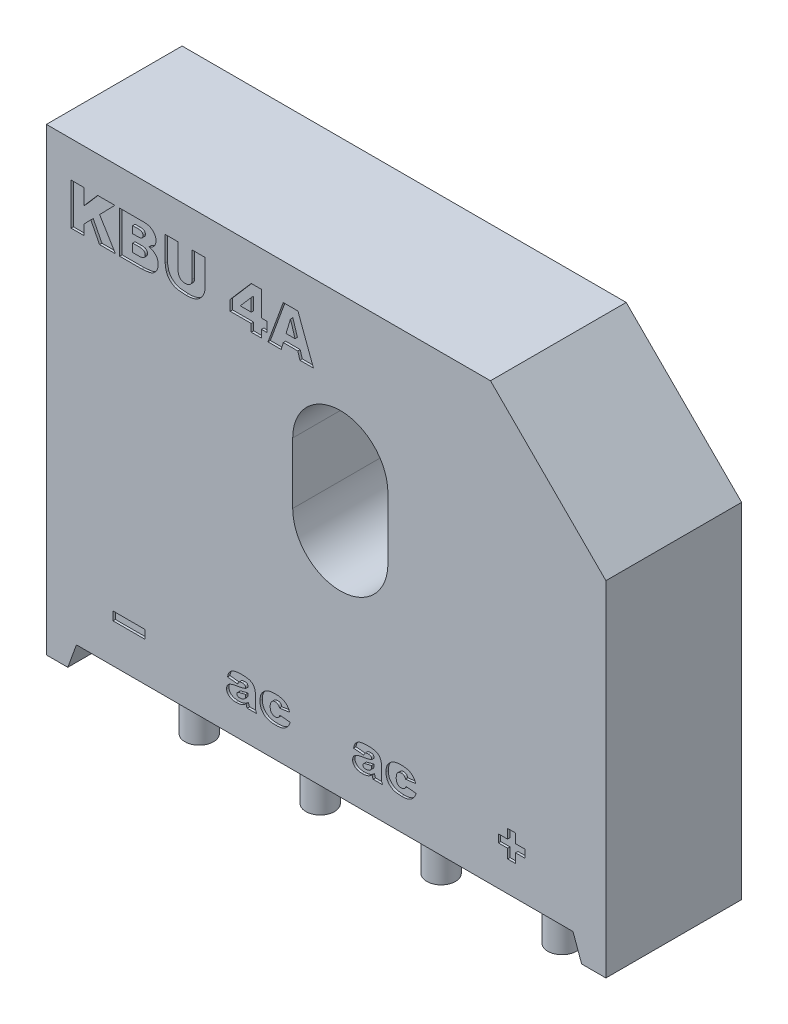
from build123d import *

# Parameters (mm, degrees)
BRIDGE_BODY_EXTRUDE_DEPTH = 5.7
SKETCH2_W                 = 1.346153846
SKETCH2_H                 = 0.358974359
PIN_TEXT_CUT_DEPTH        = 0.1
SKETCH3_R                 = 0.6
PCB_PIN_EXTRUDE_DEPTH     = 3


with BuildPart() as part:
    # Sketch1 → Bridge Body Extrude (new body)
    with BuildSketch(Plane.XY):
        Polygon((0, 0), (0, 19.3), (18.652387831, 19.3), (23.5, 14.452387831), (23.5, 0), (22.479931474, 0), (22.118360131, 1), (1.26151615, 1), (0.899944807, 0), align=None)
        with BuildLine():
            Line((10.345307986, 10.5), (10.345307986, 13.065013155))
            ThreePointArc((10.345307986, 13.065013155), (12.345307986, 15.065013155), (14.345307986, 13.065013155))
            Line((14.345307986, 13.065013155), (14.345307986, 10.5))
            ThreePointArc((14.345307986, 10.5), (12.345307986, 8.5), (10.345307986, 10.5))
        make_face(mode=Mode.SUBTRACT)
    extrude(amount=BRIDGE_BODY_EXTRUDE_DEPTH)

    # Sketch2 → Pin Text Cut (cut)
    # profile 1 of 11: a face of its own
    with BuildSketch(Plane.XY.offset(5.7)):
        with Locations((3.469213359, 2.820323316)):
            Rectangle(SKETCH2_W, SKETCH2_H)
    # profile 2 of 11: a face of its own
    with BuildSketch(Plane.XY.offset(5.7)):
        Polygon((18.981653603, 2.987122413), (19.371263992, 2.987122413), (19.371263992, 3.376732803), (19.702432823, 3.376732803), (19.702432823, 2.987122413), (20.092043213, 2.987122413), (20.092043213, 2.655953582), (19.702432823, 2.655953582), (19.702432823, 2.266343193), (19.371263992, 2.266343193), (19.371263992, 2.655953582), (18.981653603, 2.655953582), align=None)
    # profile 3 of 11: a face of its own
    with BuildSketch(Plane.XY.offset(5.7)):
        with BuildLine():
            Line((8.035976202, 2.963876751), (7.607404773, 3.00283779))
            add(Edge.make_bspline(
                [(7.607404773, 3.00283779), (7.611247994, 3.02209047), (7.618574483, 3.058792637), (7.633935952, 3.109908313), (7.650974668, 3.154884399), (7.671457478, 3.193975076), (7.695799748, 3.22857989), (7.724491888, 3.260046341), (7.757398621, 3.289564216), (7.782214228, 3.306482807), (7.794904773, 3.315134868)],
                knots=[0, 0, 0, 0, 1.250801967, 2.384454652, 3.398131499, 4.312349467, 5.189772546, 6.087297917, 7.021856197, 8, 8, 8, 8], degree=3))
            add(Edge.make_bspline(
                [(7.794904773, 3.315134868), (7.805224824, 3.32117941), (7.827022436, 3.333946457), (7.86437093, 3.348652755), (7.906607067, 3.362158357), (7.953845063, 3.372640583), (8.004622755, 3.381472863), (8.057977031, 3.387678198), (8.11342507, 3.391880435), (8.151024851, 3.392256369), (8.170209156, 3.39244818)],
                knots=[0, 0, 0, 0, 0.739921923, 1.562834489, 2.479237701, 3.48553629, 4.557106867, 5.671190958, 6.811786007, 8, 8, 8, 8], degree=3))
            add(Edge.make_bspline(
                [(8.170209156, 3.39244818), (8.185428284, 3.392380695), (8.215159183, 3.392248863), (8.258600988, 3.391487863), (8.299780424, 3.38942203), (8.338674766, 3.387568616), (8.375198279, 3.384417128), (8.4094045, 3.380808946), (8.441277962, 3.376561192), (8.480213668, 3.370339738), (8.525487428, 3.359374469), (8.575796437, 3.340537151), (8.621689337, 3.315938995), (8.64828003, 3.294655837), (8.661483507, 3.28408779)],
                knots=[0, 0, 0, 0, 1.066103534, 2.082656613, 3.043075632, 3.954156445, 4.809976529, 5.610538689, 6.363398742, 7.062112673, 8.372172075, 9.618264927, 10.817361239, 12, 12, 12, 12], degree=3))
            add(Edge.make_bspline(
                [(8.661483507, 3.28408779), (8.670167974, 3.275908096), (8.687997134, 3.259115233), (8.710417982, 3.228428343), (8.729915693, 3.19306638), (8.746122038, 3.153838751), (8.759215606, 3.112847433), (8.769063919, 3.072083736), (8.77521361, 3.032145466), (8.775898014, 3.005800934), (8.776235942, 2.992793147)],
                knots=[0, 0, 0, 0, 0.889367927, 1.825867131, 2.823050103, 3.899548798, 4.989798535, 6.033644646, 7.029098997, 8, 8, 8, 8], degree=3))
            Line((8.776235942, 2.992793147), (8.776235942, 2.513085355))
            add(Edge.make_bspline(
                [(8.776235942, 2.513085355), (8.776339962, 2.501009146), (8.776536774, 2.47816028), (8.778313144, 2.445957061), (8.781247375, 2.417899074), (8.785537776, 2.39279469), (8.792510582, 2.368459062), (8.801673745, 2.342207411), (8.813998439, 2.313043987), (8.823541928, 2.292778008), (8.828589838, 2.282058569)],
                knots=[0, 0, 0, 0, 1.20877915, 2.287078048, 3.226967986, 4.031824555, 4.832633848, 5.757700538, 6.8139634, 8, 8, 8, 8], degree=3))
            Line((8.828589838, 2.282058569), (8.435935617, 2.282058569))
            add(Edge.make_bspline(
                [(8.435935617, 2.282058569), (8.432351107, 2.288839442), (8.425649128, 2.301517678), (8.416842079, 2.319343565), (8.409945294, 2.334607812), (8.405043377, 2.348370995), (8.401110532, 2.362391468), (8.397992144, 2.378733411), (8.394205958, 2.398172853), (8.392048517, 2.412324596), (8.390886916, 2.419944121)],
                knots=[0, 0, 0, 0, 1.25880409, 2.353593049, 3.263270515, 4.005956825, 4.749389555, 5.650798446, 6.735152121, 8, 8, 8, 8], degree=3))
            add(Edge.make_bspline(
                [(8.390886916, 2.419944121), (8.377406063, 2.407510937), (8.351341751, 2.383472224), (8.309921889, 2.352729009), (8.268938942, 2.326969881), (8.240569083, 2.313939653), (8.226824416, 2.307626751)],
                knots=[0, 0, 0, 0, 1.100307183, 2.127368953, 3.092745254, 4, 4, 4, 4], degree=3))
            add(Edge.make_bspline(
                [(8.226824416, 2.307626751), (8.207685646, 2.30056634), (8.168430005, 2.286084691), (8.105342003, 2.272842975), (8.038062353, 2.263904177), (7.991670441, 2.263028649), (7.967794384, 2.26257805)],
                knots=[0, 0, 0, 0, 0.924510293, 1.896268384, 2.917293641, 4, 4, 4, 4], degree=3))
            add(Edge.make_bspline(
                [(7.967794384, 2.26257805), (7.951958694, 2.262780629), (7.921147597, 2.263174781), (7.876484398, 2.267103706), (7.834810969, 2.273864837), (7.795960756, 2.282832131), (7.760025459, 2.294722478), (7.726887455, 2.308952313), (7.696801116, 2.326024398), (7.670086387, 2.345934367), (7.646201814, 2.367542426), (7.62561109, 2.390755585), (7.607574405, 2.414720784), (7.593581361, 2.440500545), (7.582179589, 2.467138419), (7.574296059, 2.495279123), (7.569220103, 2.524466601), (7.568704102, 2.544415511), (7.568443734, 2.554481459)],
                knots=[0, 0, 0, 0, 1.369521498, 2.664643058, 3.873708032, 5.01894698, 6.109622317, 7.143303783, 8.133876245, 9.094007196, 10.0196673, 10.914657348, 11.774759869, 12.607565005, 13.445349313, 14.275931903, 15.130058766, 16, 16, 16, 16], degree=3))
            add(Edge.make_bspline(
                [(7.568443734, 2.554481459), (7.568700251, 2.563925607), (7.56920389, 2.582468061), (7.572485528, 2.609607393), (7.578388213, 2.635347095), (7.586234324, 2.659880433), (7.596638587, 2.683163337), (7.609565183, 2.705074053), (7.624350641, 2.725943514), (7.635972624, 2.738449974), (7.641800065, 2.744720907)],
                knots=[0, 0, 0, 0, 1.082829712, 2.1260065, 3.127827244, 4.106347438, 5.074859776, 6.044489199, 7.019476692, 8, 8, 8, 8], degree=3))
            add(Edge.make_bspline(
                [(7.641800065, 2.744720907), (7.648354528, 2.750878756), (7.662139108, 2.763829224), (7.686586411, 2.780482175), (7.714741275, 2.796156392), (7.74657916, 2.81067319), (7.78259294, 2.823669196), (7.822228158, 2.835692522), (7.865776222, 2.846799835), (7.896230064, 2.852731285), (7.912092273, 2.855820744)],
                knots=[0, 0, 0, 0, 0.727635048, 1.53027691, 2.387695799, 3.336632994, 4.361190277, 5.487004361, 6.691079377, 8, 8, 8, 8], degree=3))
            add(Edge.make_bspline(
                [(7.912092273, 2.855820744), (7.930862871, 2.859370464), (7.966781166, 2.866162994), (8.018023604, 2.8758766), (8.064229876, 2.884598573), (8.105033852, 2.8930373), (8.140889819, 2.899659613), (8.171191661, 2.906698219), (8.196561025, 2.911910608), (8.236015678, 2.921595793), (8.292667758, 2.937833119), (8.341761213, 2.955000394), (8.367145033, 2.963876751)],
                knots=[0, 0, 0, 0, 1.223629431, 2.341464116, 3.340736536, 4.235467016, 5.010394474, 5.675828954, 6.227778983, 6.66913235, 8.277771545, 10, 10, 10, 10], degree=3))
            add(Edge.make_bspline(
                [(8.367145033, 2.963876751), (8.36684563, 2.975567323), (8.366289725, 2.997273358), (8.361082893, 3.027045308), (8.352081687, 3.051353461), (8.338813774, 3.070588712), (8.320333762, 3.084535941), (8.296747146, 3.093890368), (8.26797192, 3.099463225), (8.246941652, 3.09996891), (8.235651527, 3.100240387)],
                knots=[0, 0, 0, 0, 1.265153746, 2.349027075, 3.256918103, 4.052578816, 4.843675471, 5.72512393, 6.778729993, 8, 8, 8, 8], degree=3))
            add(Edge.make_bspline(
                [(8.235651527, 3.100240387), (8.221009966, 3.099889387), (8.193495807, 3.099229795), (8.155079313, 3.092919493), (8.12196039, 3.082506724), (8.103671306, 3.070986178), (8.095026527, 3.065540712)],
                knots=[0, 0, 0, 0, 1.193429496, 2.242671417, 3.169356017, 4, 4, 4, 4], degree=3))
            add(Edge.make_bspline(
                [(8.095026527, 3.065540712), (8.088976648, 3.060300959), (8.076002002, 3.049063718), (8.060978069, 3.025569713), (8.046742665, 2.9970891), (8.039733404, 2.975466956), (8.035976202, 2.963876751)],
                knots=[0, 0, 0, 0, 0.801168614, 1.71819626, 2.776875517, 4, 4, 4, 4], degree=3))
        make_face()
        with BuildLine():
            add(Edge.make_bspline(
                [(8.367145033, 2.749591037), (8.338303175, 2.741380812), (8.279816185, 2.7247317), (8.220409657, 2.711737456), (8.190298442, 2.705151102)],
                knots=[0, 0, 0, 0, 0.986265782, 2, 2, 2, 2], degree=3))
            add(Edge.make_bspline(
                [(8.190298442, 2.705151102), (8.180354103, 2.702824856), (8.161352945, 2.69837998), (8.134146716, 2.691895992), (8.110063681, 2.684822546), (8.088647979, 2.678208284), (8.070317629, 2.671231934), (8.054630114, 2.664549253), (8.041700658, 2.658124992), (8.034605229, 2.652982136), (8.031410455, 2.650666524)],
                knots=[0, 0, 0, 0, 1.451033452, 2.77256417, 3.972460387, 5.016413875, 5.956143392, 6.756781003, 7.440230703, 8, 8, 8, 8], degree=3))
            add(Edge.make_bspline(
                [(8.031410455, 2.650666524), (8.026259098, 2.646072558), (8.016433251, 2.637309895), (8.005051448, 2.621867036), (7.998297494, 2.605023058), (7.997438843, 2.593396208), (7.997015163, 2.587659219)],
                knots=[0, 0, 0, 0, 1.113594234, 2.124101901, 3.074383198, 4, 4, 4, 4], degree=3))
            add(Edge.make_bspline(
                [(7.997015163, 2.587659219), (7.997391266, 2.581204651), (7.998127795, 2.568564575), (8.004970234, 2.550757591), (8.015595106, 2.534662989), (8.030923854, 2.520934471), (8.050231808, 2.509640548), (8.073748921, 2.501857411), (8.100913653, 2.497007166), (8.120368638, 2.49657332), (8.130639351, 2.496344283)],
                knots=[0, 0, 0, 0, 0.850917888, 1.666365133, 2.489182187, 3.382258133, 4.36303897, 5.428622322, 6.642513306, 8, 8, 8, 8], degree=3))
            add(Edge.make_bspline(
                [(8.130639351, 2.496344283), (8.1419236, 2.496698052), (8.164105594, 2.497393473), (8.196741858, 2.502828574), (8.228263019, 2.51120772), (8.257972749, 2.523355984), (8.285069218, 2.537779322), (8.308757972, 2.55358049), (8.327704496, 2.571642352), (8.342793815, 2.591168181), (8.354032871, 2.613266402), (8.361784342, 2.637945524), (8.366393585, 2.665613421), (8.36688604, 2.684941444), (8.367145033, 2.695106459)],
                knots=[0, 0, 0, 0, 1.164968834, 2.290035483, 3.408640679, 4.527638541, 5.596589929, 6.576223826, 7.458343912, 8.288377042, 9.113300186, 10.004832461, 10.950699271, 12, 12, 12, 12], degree=3))
            Line((8.367145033, 2.695106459), (8.367145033, 2.749591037))
        make_face(mode=Mode.SUBTRACT)
    # profile 4 of 11: a face of its own
    with BuildSketch(Plane.XY.offset(5.7)):
        with BuildLine():
            Line((9.808703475, 2.710629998), (10.237274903, 2.671668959))
            add(Edge.make_bspline(
                [(10.237274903, 2.671668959), (10.231320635, 2.651326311), (10.219643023, 2.611429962), (10.194859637, 2.554922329), (10.164996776, 2.502647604), (10.129846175, 2.454582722), (10.089544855, 2.411098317), (10.043783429, 2.372672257), (9.992472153, 2.339843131), (9.946054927, 2.316498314), (9.90606301, 2.300727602), (9.873849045, 2.290395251), (9.839552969, 2.281911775), (9.803247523, 2.275045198), (9.765004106, 2.269142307), (9.724764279, 2.265246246), (9.682608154, 2.263235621), (9.653875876, 2.262800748), (9.639162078, 2.26257805)],
                knots=[0, 0, 0, 0, 1.288639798, 2.527302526, 3.744063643, 4.945520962, 6.142433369, 7.343129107, 8.57092867, 9.840948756, 10.497848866, 11.185088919, 11.897811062, 12.646064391, 13.432730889, 14.251587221, 15.104637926, 16, 16, 16, 16], degree=3))
            add(Edge.make_bspline(
                [(9.639162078, 2.26257805), (9.611352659, 2.263010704), (9.558104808, 2.263839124), (9.481726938, 2.269416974), (9.412547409, 2.279328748), (9.349913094, 2.293157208), (9.293082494, 2.311881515), (9.240947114, 2.33545719), (9.192700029, 2.363823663), (9.148989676, 2.397494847), (9.109393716, 2.434817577), (9.074450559, 2.475812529), (9.043632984, 2.519499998), (9.0218379, 2.558765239), (9.006691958, 2.592062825), (8.99748337, 2.619387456), (8.989110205, 2.648384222), (8.9825105, 2.679518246), (8.977351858, 2.712647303), (8.973880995, 2.747711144), (8.971187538, 2.784655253), (8.97109081, 2.809954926), (8.971041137, 2.822947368)],
                knots=[0, 0, 0, 0, 1.673827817, 3.204947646, 4.605778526, 5.876902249, 7.060705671, 8.200401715, 9.314767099, 10.421374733, 11.514299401, 12.584047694, 13.658179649, 14.727038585, 15.281991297, 15.85752919, 16.460657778, 17.097882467, 17.771578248, 18.477681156, 19.218225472, 20, 20, 20, 20], degree=3))
            add(Edge.make_bspline(
                [(8.971041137, 2.822947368), (8.971211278, 2.836547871), (8.971545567, 2.863269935), (8.974316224, 2.902384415), (8.978834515, 2.93978504), (8.985305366, 2.975311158), (8.993020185, 3.009369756), (9.00318883, 3.041405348), (9.0145759, 3.071995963), (9.024135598, 3.091083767), (9.028873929, 3.10054477)],
                knots=[0, 0, 0, 0, 1.140206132, 2.240259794, 3.285912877, 4.297121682, 5.266942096, 6.211357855, 7.113447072, 8, 8, 8, 8], degree=3))
            add(Edge.make_bspline(
                [(9.028873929, 3.10054477), (9.036308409, 3.113909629), (9.051238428, 3.14074911), (9.078855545, 3.178108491), (9.109416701, 3.214011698), (9.144189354, 3.246628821), (9.180425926, 3.277008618), (9.21820513, 3.302945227), (9.256095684, 3.32554201), (9.282491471, 3.336917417), (9.29551354, 3.342529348)],
                knots=[0, 0, 0, 0, 0.999257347, 2.006721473, 3.032378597, 4.079008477, 5.120662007, 6.122032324, 7.073525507, 8, 8, 8, 8], degree=3))
            add(Edge.make_bspline(
                [(9.29551354, 3.342529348), (9.306024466, 3.346501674), (9.327646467, 3.354673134), (9.361579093, 3.364923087), (9.397787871, 3.373426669), (9.436097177, 3.380370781), (9.476625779, 3.385788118), (9.519366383, 3.389831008), (9.564265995, 3.391771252), (9.594923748, 3.392219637), (9.610550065, 3.39244818)],
                knots=[0, 0, 0, 0, 0.84030505, 1.728589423, 2.648972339, 3.621002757, 4.639558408, 5.706606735, 6.831052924, 8, 8, 8, 8], degree=3))
            add(Edge.make_bspline(
                [(9.610550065, 3.39244818), (9.632267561, 3.392131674), (9.674427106, 3.391517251), (9.735748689, 3.387480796), (9.792895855, 3.379655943), (9.84630654, 3.369962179), (9.895518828, 3.356526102), (9.940977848, 3.340405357), (9.982503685, 3.321408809), (10.019986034, 3.298900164), (10.054045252, 3.273612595), (10.085558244, 3.24594636), (10.114135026, 3.215263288), (10.140619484, 3.182309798), (10.164031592, 3.146244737), (10.184582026, 3.10741854), (10.203237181, 3.066173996), (10.212878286, 3.037128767), (10.217794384, 3.022318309)],
                knots=[0, 0, 0, 0, 1.350218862, 2.621140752, 3.817429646, 4.934536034, 5.993405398, 6.985001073, 7.930421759, 8.827204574, 9.69769175, 10.564629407, 11.43032704, 12.30115695, 13.189917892, 14.098600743, 15.030457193, 16, 16, 16, 16], degree=3))
            Line((10.217794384, 3.022318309), (9.789222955, 2.963876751))
            add(Edge.make_bspline(
                [(9.789222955, 2.963876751), (9.78617994, 2.974534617), (9.780317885, 2.995065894), (9.766863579, 3.023183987), (9.749625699, 3.046994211), (9.728871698, 3.066703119), (9.704217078, 3.081726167), (9.676073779, 3.092871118), (9.643999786, 3.099131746), (9.621433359, 3.099859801), (9.609636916, 3.100240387)],
                knots=[0, 0, 0, 0, 1.076963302, 2.074658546, 3.01442537, 3.922183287, 4.839762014, 5.805703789, 6.852946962, 8, 8, 8, 8], degree=3))
            add(Edge.make_bspline(
                [(9.609636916, 3.100240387), (9.602015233, 3.099990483), (9.58700234, 3.099498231), (9.565059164, 3.096093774), (9.544239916, 3.090614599), (9.524519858, 3.083051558), (9.506167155, 3.072768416), (9.488740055, 3.060628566), (9.472447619, 3.046081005), (9.457271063, 3.029409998), (9.443547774, 3.010457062), (9.431488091, 2.989310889), (9.421996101, 2.965639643), (9.413681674, 2.940048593), (9.407335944, 2.912133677), (9.402850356, 2.881915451), (9.400098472, 2.84937824), (9.399777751, 2.826909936), (9.399612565, 2.81533779)],
                knots=[0, 0, 0, 0, 0.915447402, 1.803212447, 2.660586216, 3.498062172, 4.332695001, 5.181448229, 6.044865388, 6.950851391, 7.884615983, 8.850676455, 9.867022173, 10.942458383, 12.080775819, 13.301223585, 14.610013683, 16, 16, 16, 16], degree=3))
            add(Edge.make_bspline(
                [(9.399612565, 2.81533779), (9.399771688, 2.804981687), (9.400079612, 2.784941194), (9.402915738, 2.755757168), (9.407295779, 2.728554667), (9.4137845, 2.703208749), (9.421954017, 2.679899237), (9.431642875, 2.658227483), (9.443620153, 2.638680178), (9.457294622, 2.621113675), (9.472228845, 2.605417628), (9.488534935, 2.59208705), (9.505457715, 2.580306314), (9.523790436, 2.571190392), (9.54291889, 2.56378135), (9.563181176, 2.558769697), (9.584241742, 2.555115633), (9.598662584, 2.554896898), (9.605984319, 2.554785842)],
                knots=[0, 0, 0, 0, 1.326048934, 2.566088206, 3.75175795, 4.851725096, 5.91206111, 6.912243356, 7.886164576, 8.840114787, 9.759173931, 10.654311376, 11.533747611, 12.393866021, 13.26993552, 14.155590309, 15.063558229, 16, 16, 16, 16], degree=3))
            add(Edge.make_bspline(
                [(9.605984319, 2.554785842), (9.618095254, 2.555235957), (9.641418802, 2.556102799), (9.674943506, 2.563257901), (9.70549306, 2.575121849), (9.732986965, 2.592182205), (9.757573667, 2.614128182), (9.778174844, 2.641722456), (9.795783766, 2.674147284), (9.804269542, 2.698109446), (9.808703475, 2.710629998)],
                knots=[0, 0, 0, 0, 1.0494911, 2.021136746, 2.957434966, 3.878054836, 4.812697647, 5.798268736, 6.849565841, 8, 8, 8, 8], degree=3))
        make_face()
    # profile 5 of 11: a face of its own
    with BuildSketch(Plane.XY.offset(5.7)):
        with BuildLine():
            Line((13.329187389, 3.021837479), (12.900615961, 3.060798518))
            add(Edge.make_bspline(
                [(12.900615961, 3.060798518), (12.904459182, 3.080051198), (12.911785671, 3.116753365), (12.927147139, 3.167869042), (12.944185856, 3.212845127), (12.964668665, 3.251935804), (12.989010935, 3.286540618), (13.017703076, 3.318007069), (13.050609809, 3.347524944), (13.075425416, 3.364443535), (13.088115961, 3.373095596)],
                knots=[0, 0, 0, 0, 1.250801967, 2.384454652, 3.398131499, 4.312349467, 5.189772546, 6.087297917, 7.021856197, 8, 8, 8, 8], degree=3))
            add(Edge.make_bspline(
                [(13.088115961, 3.373095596), (13.098436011, 3.379140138), (13.120233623, 3.391907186), (13.157582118, 3.406613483), (13.199818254, 3.420119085), (13.24705625, 3.430601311), (13.297833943, 3.439433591), (13.351188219, 3.445638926), (13.406636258, 3.449841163), (13.444236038, 3.450217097), (13.463420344, 3.450408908)],
                knots=[0, 0, 0, 0, 0.739921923, 1.562834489, 2.479237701, 3.48553629, 4.557106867, 5.671190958, 6.811786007, 8, 8, 8, 8], degree=3))
            add(Edge.make_bspline(
                [(13.463420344, 3.450408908), (13.478639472, 3.450341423), (13.508370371, 3.450209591), (13.551812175, 3.449448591), (13.592991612, 3.447382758), (13.631885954, 3.445529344), (13.668409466, 3.442377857), (13.702615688, 3.438769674), (13.73448915, 3.43452192), (13.773424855, 3.428300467), (13.818698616, 3.417335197), (13.869007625, 3.398497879), (13.914900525, 3.373899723), (13.941491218, 3.352616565), (13.954694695, 3.342048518)],
                knots=[0, 0, 0, 0, 1.066103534, 2.082656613, 3.043075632, 3.954156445, 4.809976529, 5.610538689, 6.363398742, 7.062112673, 8.372172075, 9.618264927, 10.817361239, 12, 12, 12, 12], degree=3))
            add(Edge.make_bspline(
                [(13.954694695, 3.342048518), (13.963379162, 3.333868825), (13.981208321, 3.317075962), (14.00362917, 3.286389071), (14.023126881, 3.251027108), (14.039333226, 3.211799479), (14.052426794, 3.170808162), (14.062275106, 3.130044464), (14.068424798, 3.090106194), (14.069109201, 3.063761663), (14.06944713, 3.050753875)],
                knots=[0, 0, 0, 0, 0.889367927, 1.825867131, 2.823050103, 3.899548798, 4.989798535, 6.033644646, 7.029098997, 8, 8, 8, 8], degree=3))
            Line((14.06944713, 3.050753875), (14.06944713, 2.571046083))
            add(Edge.make_bspline(
                [(14.06944713, 2.571046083), (14.06955115, 2.558969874), (14.069747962, 2.536121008), (14.071524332, 2.50391779), (14.074458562, 2.475859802), (14.078748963, 2.450755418), (14.08572177, 2.42641979), (14.094884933, 2.40016814), (14.107209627, 2.371004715), (14.116753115, 2.350738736), (14.121801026, 2.340019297)],
                knots=[0, 0, 0, 0, 1.20877915, 2.287078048, 3.226967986, 4.031824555, 4.832633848, 5.757700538, 6.8139634, 8, 8, 8, 8], degree=3))
            Line((14.121801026, 2.340019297), (13.729146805, 2.340019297))
            add(Edge.make_bspline(
                [(13.729146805, 2.340019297), (13.725562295, 2.34680017), (13.718860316, 2.359478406), (13.710053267, 2.377304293), (13.703156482, 2.39256854), (13.698254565, 2.406331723), (13.69432172, 2.420352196), (13.691203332, 2.43669414), (13.687417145, 2.456133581), (13.685259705, 2.470285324), (13.684098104, 2.477904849)],
                knots=[0, 0, 0, 0, 1.25880409, 2.353593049, 3.263270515, 4.005956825, 4.749389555, 5.650798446, 6.735152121, 8, 8, 8, 8], degree=3))
            add(Edge.make_bspline(
                [(13.684098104, 2.477904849), (13.67061725, 2.465471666), (13.644552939, 2.441432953), (13.603133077, 2.410689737), (13.562150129, 2.384930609), (13.53378027, 2.371900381), (13.520035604, 2.365587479)],
                knots=[0, 0, 0, 0, 1.100307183, 2.127368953, 3.092745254, 4, 4, 4, 4], degree=3))
            add(Edge.make_bspline(
                [(13.520035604, 2.365587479), (13.500896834, 2.358527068), (13.461641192, 2.344045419), (13.39855319, 2.330803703), (13.33127354, 2.321864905), (13.284881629, 2.320989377), (13.261005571, 2.320538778)],
                knots=[0, 0, 0, 0, 0.924510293, 1.896268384, 2.917293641, 4, 4, 4, 4], degree=3))
            add(Edge.make_bspline(
                [(13.261005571, 2.320538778), (13.245169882, 2.320741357), (13.214358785, 2.321135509), (13.169695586, 2.325064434), (13.128022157, 2.331825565), (13.089171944, 2.340792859), (13.053236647, 2.352683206), (13.020098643, 2.366913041), (12.990012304, 2.383985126), (12.963297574, 2.403895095), (12.939413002, 2.425503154), (12.918822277, 2.448716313), (12.900785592, 2.472681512), (12.886792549, 2.498461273), (12.875390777, 2.525099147), (12.867507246, 2.553239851), (12.862431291, 2.58242733), (12.861915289, 2.602376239), (12.861654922, 2.612442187)],
                knots=[0, 0, 0, 0, 1.369521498, 2.664643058, 3.873708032, 5.01894698, 6.109622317, 7.143303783, 8.133876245, 9.094007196, 10.0196673, 10.914657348, 11.774759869, 12.607565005, 13.445349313, 14.275931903, 15.130058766, 16, 16, 16, 16], degree=3))
            add(Edge.make_bspline(
                [(12.861654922, 2.612442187), (12.861911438, 2.621886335), (12.862415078, 2.640428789), (12.865696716, 2.667568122), (12.871599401, 2.693307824), (12.879445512, 2.717841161), (12.889849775, 2.741124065), (12.90277637, 2.763034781), (12.917561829, 2.783904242), (12.929183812, 2.796410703), (12.935011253, 2.802681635)],
                knots=[0, 0, 0, 0, 1.082829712, 2.1260065, 3.127827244, 4.106347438, 5.074859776, 6.044489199, 7.019476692, 8, 8, 8, 8], degree=3))
            add(Edge.make_bspline(
                [(12.935011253, 2.802681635), (12.941565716, 2.808839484), (12.955350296, 2.821789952), (12.979797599, 2.838442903), (13.007952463, 2.85411712), (13.039790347, 2.868633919), (13.075804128, 2.881629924), (13.115439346, 2.89365325), (13.15898741, 2.904760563), (13.189441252, 2.910692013), (13.205303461, 2.913781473)],
                knots=[0, 0, 0, 0, 0.727635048, 1.53027691, 2.387695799, 3.336632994, 4.361190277, 5.487004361, 6.691079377, 8, 8, 8, 8], degree=3))
            add(Edge.make_bspline(
                [(13.205303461, 2.913781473), (13.224074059, 2.917331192), (13.259992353, 2.924123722), (13.311234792, 2.933837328), (13.357441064, 2.942559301), (13.398245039, 2.950998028), (13.434101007, 2.957620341), (13.464402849, 2.964658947), (13.489772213, 2.969871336), (13.529226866, 2.979556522), (13.585878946, 2.995793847), (13.634972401, 3.012961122), (13.660356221, 3.021837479)],
                knots=[0, 0, 0, 0, 1.223629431, 2.341464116, 3.340736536, 4.235467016, 5.010394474, 5.675828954, 6.227778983, 6.66913235, 8.277771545, 10, 10, 10, 10], degree=3))
            add(Edge.make_bspline(
                [(13.660356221, 3.021837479), (13.660056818, 3.033528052), (13.659500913, 3.055234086), (13.654294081, 3.085006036), (13.645292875, 3.109314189), (13.632024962, 3.12854944), (13.61354495, 3.142496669), (13.589958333, 3.151851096), (13.561183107, 3.157423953), (13.540152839, 3.157929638), (13.528862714, 3.158201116)],
                knots=[0, 0, 0, 0, 1.265153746, 2.349027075, 3.256918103, 4.052578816, 4.843675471, 5.72512393, 6.778729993, 8, 8, 8, 8], degree=3))
            add(Edge.make_bspline(
                [(13.528862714, 3.158201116), (13.514221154, 3.157850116), (13.486706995, 3.157190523), (13.448290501, 3.150880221), (13.415171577, 3.140467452), (13.396882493, 3.128946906), (13.388237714, 3.12350144)],
                knots=[0, 0, 0, 0, 1.193429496, 2.242671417, 3.169356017, 4, 4, 4, 4], degree=3))
            add(Edge.make_bspline(
                [(13.388237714, 3.12350144), (13.382187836, 3.118261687), (13.36921319, 3.107024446), (13.354189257, 3.083530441), (13.339953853, 3.055049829), (13.332944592, 3.033427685), (13.329187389, 3.021837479)],
                knots=[0, 0, 0, 0, 0.801168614, 1.71819626, 2.776875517, 4, 4, 4, 4], degree=3))
        make_face()
        with BuildLine():
            add(Edge.make_bspline(
                [(13.660356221, 2.807551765), (13.631514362, 2.79934154), (13.573027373, 2.782692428), (13.513620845, 2.769698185), (13.48350963, 2.76311183)],
                knots=[0, 0, 0, 0, 0.986265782, 2, 2, 2, 2], degree=3))
            add(Edge.make_bspline(
                [(13.48350963, 2.76311183), (13.473565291, 2.760785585), (13.454564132, 2.756340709), (13.427357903, 2.74985672), (13.403274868, 2.742783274), (13.381859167, 2.736169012), (13.363528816, 2.729192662), (13.347841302, 2.722509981), (13.334911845, 2.71608572), (13.327816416, 2.710942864), (13.324621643, 2.708627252)],
                knots=[0, 0, 0, 0, 1.451033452, 2.77256417, 3.972460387, 5.016413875, 5.956143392, 6.756781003, 7.440230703, 8, 8, 8, 8], degree=3))
            add(Edge.make_bspline(
                [(13.324621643, 2.708627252), (13.319470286, 2.704033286), (13.309644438, 2.695270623), (13.298262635, 2.679827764), (13.291508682, 2.662983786), (13.290650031, 2.651356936), (13.290226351, 2.645619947)],
                knots=[0, 0, 0, 0, 1.113594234, 2.124101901, 3.074383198, 4, 4, 4, 4], degree=3))
            add(Edge.make_bspline(
                [(13.290226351, 2.645619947), (13.290602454, 2.639165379), (13.291338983, 2.626525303), (13.298181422, 2.60871832), (13.308806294, 2.592623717), (13.324135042, 2.578895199), (13.343442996, 2.567601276), (13.366960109, 2.559818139), (13.394124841, 2.554967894), (13.413579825, 2.554534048), (13.423850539, 2.554305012)],
                knots=[0, 0, 0, 0, 0.850917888, 1.666365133, 2.489182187, 3.382258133, 4.36303897, 5.428622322, 6.642513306, 8, 8, 8, 8], degree=3))
            add(Edge.make_bspline(
                [(13.423850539, 2.554305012), (13.435134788, 2.554658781), (13.457316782, 2.555354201), (13.489953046, 2.560789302), (13.521474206, 2.569168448), (13.551183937, 2.581316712), (13.578280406, 2.595740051), (13.60196916, 2.611541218), (13.620915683, 2.62960308), (13.636005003, 2.649128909), (13.647244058, 2.67122713), (13.65499553, 2.695906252), (13.659604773, 2.723574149), (13.660097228, 2.742902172), (13.660356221, 2.753067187)],
                knots=[0, 0, 0, 0, 1.164968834, 2.290035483, 3.408640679, 4.527638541, 5.596589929, 6.576223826, 7.458343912, 8.288377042, 9.113300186, 10.004832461, 10.950699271, 12, 12, 12, 12], degree=3))
            Line((13.660356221, 2.753067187), (13.660356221, 2.807551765))
        make_face(mode=Mode.SUBTRACT)
    # profile 6 of 11: a face of its own
    with BuildSketch(Plane.XY.offset(5.7)):
        with BuildLine():
            Line((15.101914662, 2.768590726), (15.530486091, 2.729629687))
            add(Edge.make_bspline(
                [(15.530486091, 2.729629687), (15.524531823, 2.70928704), (15.51285421, 2.66939069), (15.488070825, 2.612883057), (15.458207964, 2.560608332), (15.423057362, 2.51254345), (15.382756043, 2.469059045), (15.336994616, 2.430632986), (15.28568334, 2.397803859), (15.239266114, 2.374459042), (15.199274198, 2.35868833), (15.167060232, 2.348355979), (15.132764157, 2.339872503), (15.096458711, 2.333005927), (15.058215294, 2.327103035), (15.017975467, 2.323206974), (14.975819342, 2.321196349), (14.947087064, 2.320761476), (14.932373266, 2.320538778)],
                knots=[0, 0, 0, 0, 1.288639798, 2.527302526, 3.744063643, 4.945520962, 6.142433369, 7.343129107, 8.57092867, 9.840948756, 10.497848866, 11.185088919, 11.897811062, 12.646064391, 13.432730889, 14.251587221, 15.104637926, 16, 16, 16, 16], degree=3))
            add(Edge.make_bspline(
                [(14.932373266, 2.320538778), (14.904563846, 2.320971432), (14.851315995, 2.321799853), (14.774938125, 2.327377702), (14.705758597, 2.337289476), (14.643124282, 2.351117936), (14.586293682, 2.369842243), (14.534158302, 2.393417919), (14.485911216, 2.421784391), (14.442200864, 2.455455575), (14.402604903, 2.492778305), (14.367661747, 2.533773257), (14.336844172, 2.577460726), (14.315049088, 2.616725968), (14.299903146, 2.650023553), (14.290694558, 2.677348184), (14.282321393, 2.70634495), (14.275721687, 2.737478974), (14.270563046, 2.770608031), (14.267092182, 2.805671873), (14.264398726, 2.842615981), (14.264301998, 2.867915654), (14.264252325, 2.880908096)],
                knots=[0, 0, 0, 0, 1.673827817, 3.204947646, 4.605778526, 5.876902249, 7.060705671, 8.200401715, 9.314767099, 10.421374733, 11.514299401, 12.584047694, 13.658179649, 14.727038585, 15.281991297, 15.85752919, 16.460657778, 17.097882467, 17.771578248, 18.477681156, 19.218225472, 20, 20, 20, 20], degree=3))
            add(Edge.make_bspline(
                [(14.264252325, 2.880908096), (14.264422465, 2.894508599), (14.264756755, 2.921230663), (14.267527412, 2.960345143), (14.272045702, 2.997745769), (14.278516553, 3.033271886), (14.286231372, 3.067330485), (14.296400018, 3.099366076), (14.307787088, 3.129956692), (14.317346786, 3.149044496), (14.322085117, 3.158505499)],
                knots=[0, 0, 0, 0, 1.140206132, 2.240259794, 3.285912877, 4.297121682, 5.266942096, 6.211357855, 7.113447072, 8, 8, 8, 8], degree=3))
            add(Edge.make_bspline(
                [(14.322085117, 3.158505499), (14.329519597, 3.171870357), (14.344449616, 3.198709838), (14.372066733, 3.236069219), (14.402627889, 3.271972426), (14.437400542, 3.304589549), (14.473637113, 3.334969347), (14.511416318, 3.360905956), (14.549306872, 3.383502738), (14.575702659, 3.394878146), (14.588724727, 3.400490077)],
                knots=[0, 0, 0, 0, 0.999257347, 2.006721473, 3.032378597, 4.079008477, 5.120662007, 6.122032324, 7.073525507, 8, 8, 8, 8], degree=3))
            add(Edge.make_bspline(
                [(14.588724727, 3.400490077), (14.599235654, 3.404462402), (14.620857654, 3.412633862), (14.65479028, 3.422883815), (14.690999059, 3.431387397), (14.729308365, 3.438331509), (14.769836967, 3.443748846), (14.812577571, 3.447791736), (14.857477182, 3.44973198), (14.888134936, 3.450180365), (14.903761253, 3.450408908)],
                knots=[0, 0, 0, 0, 0.84030505, 1.728589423, 2.648972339, 3.621002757, 4.639558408, 5.706606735, 6.831052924, 8, 8, 8, 8], degree=3))
            add(Edge.make_bspline(
                [(14.903761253, 3.450408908), (14.925478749, 3.450092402), (14.967638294, 3.44947798), (15.028959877, 3.445441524), (15.086107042, 3.437616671), (15.139517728, 3.427922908), (15.188730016, 3.41448683), (15.234189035, 3.398366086), (15.275714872, 3.379369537), (15.313197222, 3.356860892), (15.347256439, 3.331573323), (15.378769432, 3.303907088), (15.407346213, 3.273224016), (15.433830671, 3.240270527), (15.457242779, 3.204205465), (15.477793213, 3.165379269), (15.496448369, 3.124134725), (15.506089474, 3.095089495), (15.511005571, 3.080279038)],
                knots=[0, 0, 0, 0, 1.350218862, 2.621140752, 3.817429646, 4.934536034, 5.993405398, 6.985001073, 7.930421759, 8.827204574, 9.69769175, 10.564629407, 11.43032704, 12.30115695, 13.189917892, 14.098600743, 15.030457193, 16, 16, 16, 16], degree=3))
            Line((15.511005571, 3.080279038), (15.082434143, 3.021837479))
            add(Edge.make_bspline(
                [(15.082434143, 3.021837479), (15.079391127, 3.032495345), (15.073529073, 3.053026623), (15.060074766, 3.081144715), (15.042836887, 3.104954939), (15.022082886, 3.124663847), (14.997428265, 3.139686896), (14.969284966, 3.150831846), (14.937210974, 3.157092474), (14.914644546, 3.15782053), (14.902848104, 3.158201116)],
                knots=[0, 0, 0, 0, 1.076963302, 2.074658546, 3.01442537, 3.922183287, 4.839762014, 5.805703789, 6.852946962, 8, 8, 8, 8], degree=3))
            add(Edge.make_bspline(
                [(14.902848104, 3.158201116), (14.895226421, 3.157951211), (14.880213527, 3.157458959), (14.858270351, 3.154054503), (14.837451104, 3.148575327), (14.817731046, 3.141012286), (14.799378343, 3.130729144), (14.781951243, 3.118589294), (14.765658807, 3.104041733), (14.750482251, 3.087370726), (14.736758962, 3.068417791), (14.724699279, 3.047271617), (14.715207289, 3.023600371), (14.706892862, 2.998009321), (14.700547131, 2.970094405), (14.696061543, 2.939876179), (14.693309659, 2.907338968), (14.692988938, 2.884870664), (14.692823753, 2.873298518)],
                knots=[0, 0, 0, 0, 0.915447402, 1.803212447, 2.660586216, 3.498062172, 4.332695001, 5.181448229, 6.044865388, 6.950851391, 7.884615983, 8.850676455, 9.867022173, 10.942458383, 12.080775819, 13.301223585, 14.610013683, 16, 16, 16, 16], degree=3))
            add(Edge.make_bspline(
                [(14.692823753, 2.873298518), (14.692982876, 2.862942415), (14.693290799, 2.842901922), (14.696126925, 2.813717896), (14.700506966, 2.786515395), (14.706995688, 2.761169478), (14.715165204, 2.737859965), (14.724854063, 2.716188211), (14.736831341, 2.696640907), (14.750505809, 2.679074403), (14.765440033, 2.663378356), (14.781746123, 2.650047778), (14.798668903, 2.638267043), (14.817001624, 2.629151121), (14.836130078, 2.621742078), (14.856392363, 2.616730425), (14.877452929, 2.613076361), (14.891873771, 2.612857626), (14.899195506, 2.61274657)],
                knots=[0, 0, 0, 0, 1.326048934, 2.566088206, 3.75175795, 4.851725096, 5.91206111, 6.912243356, 7.886164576, 8.840114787, 9.759173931, 10.654311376, 11.533747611, 12.393866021, 13.26993552, 14.155590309, 15.063558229, 16, 16, 16, 16], degree=3))
            add(Edge.make_bspline(
                [(14.899195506, 2.61274657), (14.911306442, 2.613196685), (14.93462999, 2.614063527), (14.968154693, 2.621218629), (14.998704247, 2.633082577), (15.026198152, 2.650142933), (15.050784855, 2.672088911), (15.071386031, 2.699683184), (15.088994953, 2.732108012), (15.09748073, 2.756070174), (15.101914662, 2.768590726)],
                knots=[0, 0, 0, 0, 1.0494911, 2.021136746, 2.957434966, 3.878054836, 4.812697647, 5.798268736, 6.849565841, 8, 8, 8, 8], degree=3))
        make_face()
    # profile 7 of 11: a face of its own
    with BuildSketch(Plane.XY.offset(5.7)):
        Polygon((1.035159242, 17.792811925), (1.580613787, 17.792811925), (1.580613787, 17.131590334), (2.151281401, 17.792811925), (2.876068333, 17.792811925), (2.236863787, 17.137982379), (2.898795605, 16.042811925), (2.23224731, 16.042811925), (1.866835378, 16.758721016), (1.580613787, 16.465752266), (1.580613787, 16.042811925), (1.035159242, 16.042811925), align=None)
    # profile 8 of 11: a face of its own
    with BuildSketch(Plane.XY.offset(5.7)):
        with BuildLine():
            Line((3.080613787, 17.792811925), (4.08380981, 17.792811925))
            add(Edge.make_bspline(
                [(4.08380981, 17.792811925), (4.104184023, 17.792521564), (4.143715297, 17.791958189), (4.201172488, 17.786166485), (4.255002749, 17.776729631), (4.305134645, 17.763239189), (4.351720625, 17.746237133), (4.394616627, 17.725229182), (4.433856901, 17.70025091), (4.469368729, 17.671817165), (4.500877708, 17.640720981), (4.528207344, 17.607341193), (4.551167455, 17.572103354), (4.570827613, 17.535374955), (4.585227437, 17.496473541), (4.595547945, 17.45587843), (4.602181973, 17.413530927), (4.602950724, 17.384574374), (4.60334106, 17.369871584)],
                knots=[0, 0, 0, 0, 1.297654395, 2.517787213, 3.674586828, 4.77585146, 5.820915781, 6.829339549, 7.812606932, 8.77836667, 9.72223708, 10.627980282, 11.521109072, 12.398141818, 13.276373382, 14.156157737, 15.063782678, 16, 16, 16, 16], degree=3))
            add(Edge.make_bspline(
                [(4.60334106, 17.369871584), (4.603106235, 17.357545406), (4.602643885, 17.333276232), (4.597834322, 17.297496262), (4.590132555, 17.262980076), (4.578972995, 17.229877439), (4.565163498, 17.198029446), (4.547966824, 17.167729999), (4.527626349, 17.138701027), (4.511896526, 17.120795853), (4.503909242, 17.11170397)],
                knots=[0, 0, 0, 0, 1.04282744, 2.053236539, 3.049839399, 4.032084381, 5.005705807, 5.983802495, 6.976215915, 8, 8, 8, 8], degree=3))
            add(Edge.make_bspline(
                [(4.503909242, 17.11170397), (4.491947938, 17.099917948), (4.467141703, 17.075475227), (4.421258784, 17.045746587), (4.368604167, 17.018838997), (4.329860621, 17.00518564), (4.309662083, 16.998067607)],
                knots=[0, 0, 0, 0, 0.884375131, 1.834082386, 2.870821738, 4, 4, 4, 4], degree=3))
            add(Edge.make_bspline(
                [(4.309662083, 16.998067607), (4.325688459, 16.993978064), (4.356804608, 16.986037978), (4.401555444, 16.971581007), (4.442760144, 16.954254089), (4.481174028, 16.935874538), (4.51594507, 16.914549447), (4.547656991, 16.891538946), (4.57627769, 16.866374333), (4.601119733, 16.838682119), (4.623471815, 16.809563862), (4.642083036, 16.77814593), (4.658350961, 16.745221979), (4.671400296, 16.710332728), (4.681697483, 16.673621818), (4.689208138, 16.635162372), (4.693448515, 16.594873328), (4.693979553, 16.56744291), (4.694250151, 16.553465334)],
                knots=[0, 0, 0, 0, 1.232819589, 2.393591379, 3.501302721, 4.562821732, 5.564607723, 6.537052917, 7.480854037, 8.39906542, 9.306143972, 10.212578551, 11.116260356, 12.040556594, 12.984728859, 13.955531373, 14.958210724, 16, 16, 16, 16], degree=3))
            add(Edge.make_bspline(
                [(4.694250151, 16.553465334), (4.693535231, 16.53068575), (4.692136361, 16.486113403), (4.68007917, 16.421004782), (4.660149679, 16.35950183), (4.632307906, 16.301958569), (4.597992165, 16.24903233), (4.55738191, 16.201673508), (4.511125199, 16.15986363), (4.476083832, 16.137509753), (4.458454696, 16.126263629)],
                knots=[0, 0, 0, 0, 1.069033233, 2.091755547, 3.097262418, 4.096727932, 5.085032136, 6.050930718, 7.019433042, 8, 8, 8, 8], degree=3))
            add(Edge.make_bspline(
                [(4.458454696, 16.126263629), (4.445824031, 16.119633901), (4.418551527, 16.105318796), (4.370949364, 16.090213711), (4.315360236, 16.076496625), (4.275050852, 16.0705083), (4.253554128, 16.067314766)],
                knots=[0, 0, 0, 0, 0.796985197, 1.720873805, 2.784557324, 4, 4, 4, 4], degree=3))
            add(Edge.make_bspline(
                [(4.253554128, 16.067314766), (4.238996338, 16.065406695), (4.211191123, 16.061762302), (4.171419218, 16.056774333), (4.135432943, 16.052530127), (4.10337994, 16.048806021), (4.075044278, 16.046553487), (4.050580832, 16.044133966), (4.029841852, 16.043109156), (4.017285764, 16.042903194), (4.011721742, 16.042811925)],
                knots=[0, 0, 0, 0, 1.448973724, 2.76752333, 3.95568902, 5.025137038, 5.951619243, 6.760708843, 7.450828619, 8, 8, 8, 8], degree=3))
            Line((4.011721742, 16.042811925), (3.080613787, 16.042811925))
            Line((3.080613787, 16.042811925), (3.080613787, 17.792811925))
        make_face()
        with BuildLine():
            Line((3.626068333, 17.133721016), (3.846593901, 17.133721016))
            add(Edge.make_bspline(
                [(3.846593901, 17.133721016), (3.856066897, 17.133870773), (3.874319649, 17.134159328), (3.900624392, 17.135975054), (3.924732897, 17.138629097), (3.94661592, 17.142828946), (3.965998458, 17.148600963), (3.983400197, 17.154836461), (3.998494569, 17.16266611), (4.015347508, 17.174871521), (4.032616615, 17.193416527), (4.047422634, 17.22009815), (4.056581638, 17.251033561), (4.057438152, 17.27309547), (4.057886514, 17.284644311)],
                knots=[0, 0, 0, 0, 1.145480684, 2.207134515, 3.187201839, 4.077092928, 4.897001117, 5.630796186, 6.309468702, 6.945115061, 8.140144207, 9.338597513, 10.606824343, 12, 12, 12, 12], degree=3))
            add(Edge.make_bspline(
                [(4.057886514, 17.284644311), (4.057432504, 17.295485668), (4.056561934, 17.31627406), (4.047363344, 17.345468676), (4.0323632, 17.370689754), (4.011481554, 17.392518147), (3.98268283, 17.409626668), (3.945706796, 17.421184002), (3.900461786, 17.42794656), (3.867572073, 17.428744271), (3.849789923, 17.429175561)],
                knots=[0, 0, 0, 0, 0.898975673, 1.7237933, 2.513644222, 3.320957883, 4.208713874, 5.266782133, 6.522258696, 8, 8, 8, 8], degree=3))
            Line((3.849789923, 17.429175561), (3.626068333, 17.429175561))
            Line((3.626068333, 17.429175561), (3.626068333, 17.133721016))
        make_face(mode=Mode.SUBTRACT)
        with BuildLine():
            Line((3.626068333, 16.451902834), (3.898085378, 16.451902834))
            add(Edge.make_bspline(
                [(3.898085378, 16.451902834), (3.909096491, 16.45204125), (3.930430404, 16.452309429), (3.961163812, 16.454293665), (3.98939439, 16.458205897), (4.014963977, 16.46362124), (4.038190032, 16.469673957), (4.058774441, 16.478003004), (4.076764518, 16.487806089), (4.097209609, 16.502510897), (4.118068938, 16.524201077), (4.135909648, 16.555066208), (4.147012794, 16.590010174), (4.148186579, 16.614814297), (4.148795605, 16.627684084)],
                knots=[0, 0, 0, 0, 1.137803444, 2.204481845, 3.180101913, 4.079687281, 4.904664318, 5.65648604, 6.368130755, 7.016521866, 8.253609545, 9.443098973, 10.673334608, 12, 12, 12, 12], degree=3))
            add(Edge.make_bspline(
                [(4.148795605, 16.627684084), (4.148138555, 16.639597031), (4.146869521, 16.662605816), (4.136256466, 16.695439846), (4.117811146, 16.7239767), (4.097320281, 16.744593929), (4.07724536, 16.758622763), (4.059212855, 16.767901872), (4.038556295, 16.775573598), (4.015266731, 16.781972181), (3.989365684, 16.786821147), (3.960900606, 16.790307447), (3.929841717, 16.792451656), (3.908268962, 16.79268845), (3.897020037, 16.792811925)],
                knots=[0, 0, 0, 0, 1.255417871, 2.424726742, 3.592633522, 4.811599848, 5.466560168, 6.1705524, 6.945451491, 7.787981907, 8.716507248, 9.723634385, 10.813008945, 12, 12, 12, 12], degree=3))
            Line((3.897020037, 16.792811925), (3.626068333, 16.792811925))
            Line((3.626068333, 16.792811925), (3.626068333, 16.451902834))
        make_face(mode=Mode.SUBTRACT)
    # profile 9 of 11: a face of its own
    with BuildSketch(Plane.XY.offset(5.7)):
        with BuildLine():
            Line((6.126068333, 17.792811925), (6.671522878, 17.792811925))
            Line((6.671522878, 17.792811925), (6.671522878, 16.754459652))
            add(Edge.make_bspline(
                [(6.671522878, 16.754459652), (6.670849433, 16.729105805), (6.669514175, 16.678835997), (6.660660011, 16.604512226), (6.645147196, 16.532339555), (6.624160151, 16.462522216), (6.596505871, 16.395844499), (6.561886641, 16.333195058), (6.520031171, 16.275029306), (6.47202684, 16.222083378), (6.420431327, 16.174812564), (6.366478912, 16.134826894), (6.311496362, 16.101756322), (6.272836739, 16.086025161), (6.253909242, 16.078323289)],
                knots=[0, 0, 0, 0, 1.078694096, 2.138758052, 3.178859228, 4.215981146, 5.236387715, 6.244050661, 7.254528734, 8.277963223, 9.279706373, 10.226520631, 11.131716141, 12, 12, 12, 12], degree=3))
            add(Edge.make_bspline(
                [(6.253909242, 16.078323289), (6.240453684, 16.073705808), (6.213032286, 16.064295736), (6.170531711, 16.052228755), (6.125919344, 16.042362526), (6.079465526, 16.034230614), (6.031007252, 16.027872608), (5.980552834, 16.02316649), (5.928054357, 16.020875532), (5.892405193, 16.020351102), (5.874292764, 16.020084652)],
                knots=[0, 0, 0, 0, 0.884417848, 1.802375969, 2.745165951, 3.7240648, 4.733744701, 5.783225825, 6.873713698, 8, 8, 8, 8], degree=3))
            add(Edge.make_bspline(
                [(5.874292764, 16.020084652), (5.852388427, 16.020258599), (5.807723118, 16.020613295), (5.739304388, 16.024624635), (5.667988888, 16.029717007), (5.595218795, 16.037328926), (5.523839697, 16.047490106), (5.457223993, 16.063189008), (5.396600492, 16.082822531), (5.341562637, 16.10729241), (5.290996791, 16.137060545), (5.243201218, 16.172065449), (5.19774964, 16.212813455), (5.154895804, 16.258103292), (5.116382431, 16.306441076), (5.084105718, 16.356669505), (5.057993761, 16.407336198), (5.046000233, 16.442504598), (5.040130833, 16.459715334)],
                knots=[0, 0, 0, 0, 1.032427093, 2.105230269, 3.229919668, 4.402573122, 5.553951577, 6.625898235, 7.624631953, 8.553790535, 9.459119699, 10.385459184, 11.341896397, 12.332632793, 13.321733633, 14.25042296, 15.143790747, 16, 16, 16, 16], degree=3))
            add(Edge.make_bspline(
                [(5.040130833, 16.459715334), (5.032400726, 16.486489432), (5.017461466, 16.538233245), (5.00221941, 16.614495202), (4.991690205, 16.685986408), (4.990350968, 16.732172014), (4.989704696, 16.754459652)],
                knots=[0, 0, 0, 0, 1.114178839, 2.153269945, 3.108829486, 4, 4, 4, 4], degree=3))
            Line((4.989704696, 16.754459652), (4.989704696, 17.792811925))
            Line((4.989704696, 17.792811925), (5.535159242, 17.792811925))
            Line((5.535159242, 17.792811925), (5.535159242, 16.731377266))
            add(Edge.make_bspline(
                [(5.535159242, 16.731377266), (5.535282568, 16.719880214), (5.53552364, 16.697406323), (5.539775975, 16.664683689), (5.545463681, 16.633822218), (5.554233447, 16.604976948), (5.565063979, 16.57798837), (5.578747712, 16.552920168), (5.594682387, 16.529704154), (5.613307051, 16.508763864), (5.633748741, 16.489871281), (5.656545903, 16.473760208), (5.681032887, 16.459920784), (5.707400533, 16.448405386), (5.735853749, 16.440070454), (5.765961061, 16.433503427), (5.798105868, 16.430150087), (5.820072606, 16.429505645), (5.831324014, 16.429175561)],
                knots=[0, 0, 0, 0, 1.148258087, 2.244560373, 3.293417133, 4.281659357, 5.252825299, 6.195239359, 7.130645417, 8.061174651, 8.990800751, 9.906849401, 10.844647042, 11.798577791, 12.775492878, 13.803520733, 14.874958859, 16, 16, 16, 16], degree=3))
            add(Edge.make_bspline(
                [(5.831324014, 16.429175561), (5.842466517, 16.429302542), (5.864351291, 16.429551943), (5.896125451, 16.433782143), (5.926228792, 16.439414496), (5.954116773, 16.448703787), (5.980475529, 16.459413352), (6.004836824, 16.473122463), (6.027365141, 16.489170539), (6.047914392, 16.507678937), (6.066641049, 16.52831816), (6.082481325, 16.551505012), (6.096058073, 16.576489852), (6.107222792, 16.603479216), (6.115622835, 16.632563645), (6.121512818, 16.663724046), (6.125704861, 16.696818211), (6.125944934, 16.719644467), (6.126068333, 16.731377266)],
                knots=[0, 0, 0, 0, 1.114383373, 2.188738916, 3.204242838, 4.174785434, 5.125450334, 6.048464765, 6.965833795, 7.888848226, 8.811862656, 9.748616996, 10.692389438, 11.653994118, 12.666382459, 13.716751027, 14.826399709, 16, 16, 16, 16], degree=3))
            Line((6.126068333, 16.731377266), (6.126068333, 17.792811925))
        make_face()
    # profile 10 of 11: a face of its own
    with BuildSketch(Plane.XY.offset(5.7)):
        Polygon((8.60334106, 16.360993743), (7.716977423, 16.360993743), (7.716977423, 16.792101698), (8.60334106, 17.815539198), (9.035159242, 17.815539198), (9.035159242, 16.770084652), (9.262431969, 16.770084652), (9.262431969, 16.360993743), (9.035159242, 16.360993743), (9.035159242, 16.042811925), (8.60334106, 16.042811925), align=None)
        Polygon((8.60334106, 16.770084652), (8.60334106, 17.30311022), (8.141693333, 16.770084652), align=None, mode=Mode.SUBTRACT)
    # profile 11 of 11: a face of its own
    with BuildSketch(Plane.XY.offset(5.7)):
        Polygon((10.559662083, 16.33826647), (9.950287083, 16.33826647), (9.861863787, 16.042811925), (9.307886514, 16.042811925), (9.949221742, 17.792811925), (10.564633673, 17.792811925), (11.216977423, 16.042811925), (10.648085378, 16.042811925), align=None)
        Polygon((10.443895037, 16.724630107), (10.251068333, 17.345368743), (10.065699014, 16.724630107), align=None, mode=Mode.SUBTRACT)
    extrude(amount=-PIN_TEXT_CUT_DEPTH, mode=Mode.SUBTRACT)

    # Sketch3 → PCB Pin Extrude (add)
    with BuildSketch(Plane.XZ.offset(-1)):
        with Locations(Location((9.149938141, 3.35, 0), (0, 0, 90))):
            Circle(SKETCH3_R)
        with Locations(Location((4.069938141, 3.35, 0), (0, 0, 90))):
            Circle(SKETCH3_R)
        with Locations(Location((14.229938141, 3.35, 0), (0, 0, 90))):
            Circle(SKETCH3_R)
        with Locations(Location((19.309938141, 3.35, 0), (0, 0, 90))):
            Circle(SKETCH3_R)
    extrude(amount=PCB_PIN_EXTRUDE_DEPTH)


solid = part.part
